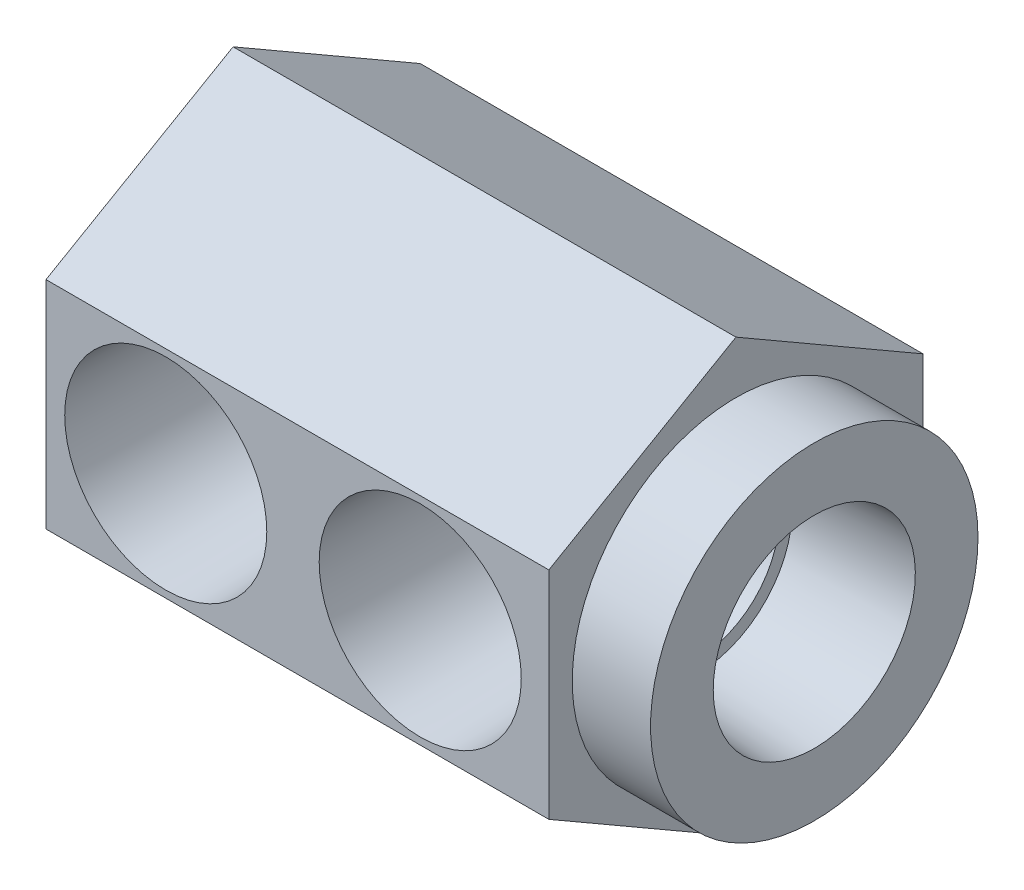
from build123d import *

# Parameters (mm, degrees)
BOSS_EXTRUDE1_DEPTH                = 34.13125
SKETCH3_R                          = 11.1125
BOSS_EXTRUDE2_DEPTH                = 5.31622
F_1_4_NPT_TAPPED_HOLE2_AT_2_COUNT  = 2
F_1_4_NPT_TAPPED_HOLE2_AT_2_PITCH  = 17.272
F_5_16_24_TAPPED_HOLE1_D           = 6.9088
F_5_16_24_TAPPED_HOLE1_DEPTH       = 28.57754
F_5_16_24_TAPPED_HOLE1_CBORE_D     = 7.9375
F_5_16_24_TAPPED_HOLE1_CBORE_DEPTH = 27.178
F_5_16_24_TAPPED_HOLE1_TIP         = 2.075612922


with BuildPart() as part:
    # Sketch2 → Boss-Extrude1 (new body)
    with BuildSketch(Plane(origin=(0, 0, 0), x_dir=(0, 0, -1), z_dir=(1, 0, 0))):
        Polygon((-12.7, -7.332348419), (0, -14.664696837), (12.7, -7.332348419), (12.7, 7.332348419), (0, 14.664696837), (-12.7, 7.332348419), align=None)
    extrude(amount=BOSS_EXTRUDE1_DEPTH)

    # Sketch3 → Boss-Extrude2 (add)
    with BuildSketch(Plane(origin=(34.13125, 0, 0), x_dir=(0, 0, -1), z_dir=(1, 0, 0))):
        Circle(SKETCH3_R)
    extrude(amount=BOSS_EXTRUDE2_DEPTH)

    # Sketch4 → Cut-Revolve1 (revolve, cut)
    with BuildSketch(Plane(origin=(0, 0, 0), x_dir=(1, 0, 0), z_dir=(0, 1, 0)), mode=Mode.PRIVATE) as cut_revolve1_sk:
        Polygon((39.44747, 6.85927), (31.50997, 6.443283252), (31.50997, 5.55625), (26.74747, 5.55625), (26.74747, 0), (39.44747, 0), align=None)
    revolve(cut_revolve1_sk.sketch.rotate(Axis((-12.216170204, 0, 0), (1, 0, 0)), 180), axis=Axis((-12.216170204, 0, 0), (1, 0, 0)), mode=Mode.SUBTRACT)

    # Sketch5 → 1_4 NPT Tapped Hole1 (revolve, cut)
    with BuildSketch(Plane(origin=(8.128, 0, -12.7), x_dir=(0, 1, 0), z_dir=(1, 0, 0))):
        Polygon((0, 0), (0, 20.411147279), (5.5626, 17.0688), (5.5626, 10.0203), (6.557978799, 10.0203), (6.858, 0), align=None)
    revolve(axis=Axis((8.128, 0, -19.05), (0, 0, 1)), mode=Mode.SUBTRACT)

    # Sketch7 → 1_4 NPT Tapped Hole2 (revolve, cut)
    with BuildSketch(Plane(origin=(8.128, 0, 12.7), x_dir=(0, -1, 0), z_dir=(1, 0, 0))):
        Polygon((0, 0), (0, 20.411147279), (5.5626, 17.0688), (5.5626, 10.0203), (6.557978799, 10.0203), (6.858, 0), align=None)
    f_1_4_npt_tapped_hole2 = revolve(axis=Axis((8.128, 0, 19.05), (0, 0, -1)), mode=Mode.SUBTRACT)

    # 1_4 NPT Tapped Hole2 at 2: 1_4 NPT Tapped Hole2 ×2
    with Locations(*[(i * F_1_4_NPT_TAPPED_HOLE2_AT_2_PITCH, 0, 0) for i in range(1, F_1_4_NPT_TAPPED_HOLE2_AT_2_COUNT)]):
        add(f_1_4_npt_tapped_hole2, mode=Mode.SUBTRACT)

    # 5_16-24 Tapped Hole1
    with Locations(Plane(origin=(39.44747, 0, 0), x_dir=(0, 0, -1), z_dir=(1, 0, 0))):
        with Locations((0, 0)):
            CounterBoreHole(F_5_16_24_TAPPED_HOLE1_D / 2, F_5_16_24_TAPPED_HOLE1_CBORE_D / 2, F_5_16_24_TAPPED_HOLE1_CBORE_DEPTH, depth=F_5_16_24_TAPPED_HOLE1_DEPTH)
            with Locations((0, 0, -(F_5_16_24_TAPPED_HOLE1_DEPTH + F_5_16_24_TAPPED_HOLE1_TIP / 2))):  # 118° drill point
                Cone(0, F_5_16_24_TAPPED_HOLE1_D / 2, F_5_16_24_TAPPED_HOLE1_TIP, mode=Mode.SUBTRACT)


solid = part.part
